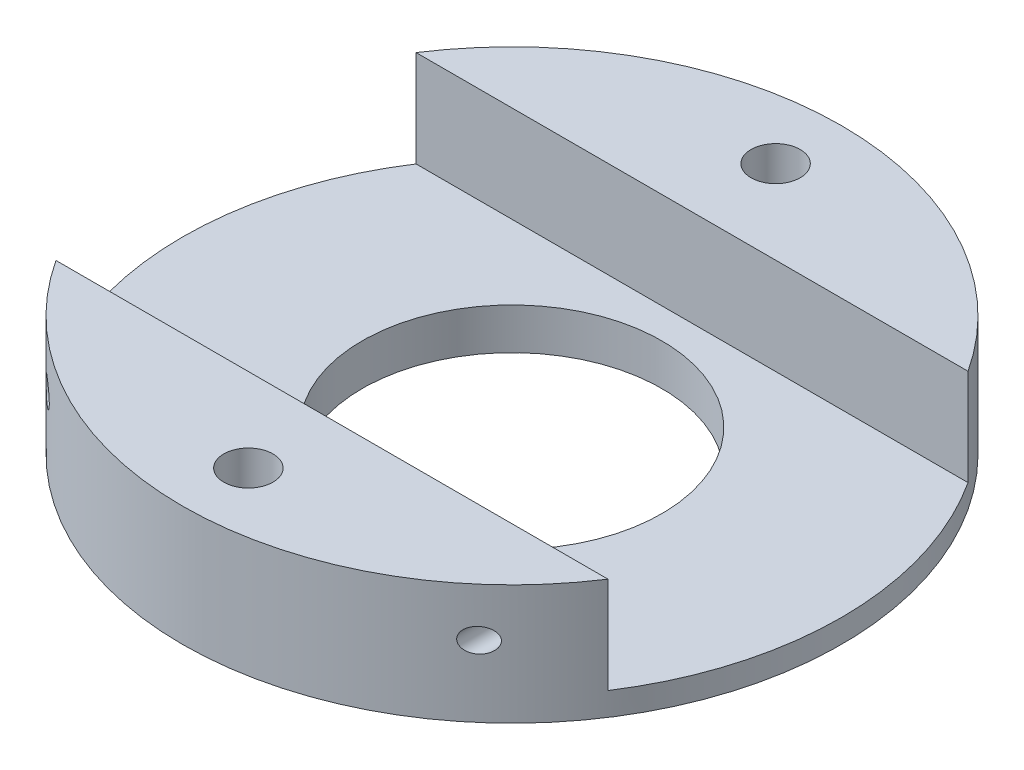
from build123d import *

# Parameters (mm, degrees)
SKETCH1_R                  = 27.5
BOSS_EXTRUDE1_DEPTH        = 10
SKETCH2_W                  = 60
SKETCH2_H                  = 30.05
CUT_EXTRUDE1_DEPTH         = 8.05
F_4_1_4_1_DIAMETER_HOLE1_D = 4.1
SKETCH7_R                  = 1
CUT_EXTRUDE3_DEPTH         = 25
SKETCH8_R                  = 14.45
BOSS_EXTRUDE2_DEPTH        = 1.5
SKETCH9_R                  = 12.5
CUT_EXTRUDE4_DEPTH         = 40.715268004


with BuildPart() as part:
    # Sketch1 → Boss-Extrude1 (new body)
    with BuildSketch(Plane(origin=(0, 0, 0), x_dir=(1, 0, 0), z_dir=(0, 1, 0))):
        with Locations(Location((0, 0, 0), (0, 0, 270))):
            Circle(SKETCH1_R)
    extrude(amount=BOSS_EXTRUDE1_DEPTH)

    # Sketch2 → Cut-Extrude1 (cut)
    with BuildSketch(Plane(origin=(0, 10, 0), x_dir=(1, 0, 0), z_dir=(0, 1, 0))):
        Rectangle(SKETCH2_W, SKETCH2_H)
    extrude(amount=-CUT_EXTRUDE1_DEPTH, mode=Mode.SUBTRACT)

    # 4.1 _4.1_ Diameter Hole1 (through all)
    with Locations(Plane(origin=(0, 10, 0), x_dir=(1, 0, 0), z_dir=(0, 1, 0))):
        with Locations((0, 22), (0, -22)):
            Hole(F_4_1_4_1_DIAMETER_HOLE1_D / 2)

    # Sketch7 → Cut-Extrude3 (cut)
    with BuildSketch(Plane.XY):
        with Locations(Location((-18, 5.95, 0), (0, 0, 180))):
            Circle(SKETCH7_R)
        with Locations(Location((18, 5.95, 0), (0, 0, 180))):
            Circle(SKETCH7_R)
    extrude(amount=CUT_EXTRUDE3_DEPTH, mode=Mode.SUBTRACT)

    # Sketch8 → Boss-Extrude2 (add)
    with BuildSketch(Plane(origin=(0, 0, 0), x_dir=(-1, 0, 0), z_dir=(0, -1, 0))):
        with Locations(Location((0, 0, 0), (0, 0, 270))):
            Circle(SKETCH8_R)
    extrude(amount=BOSS_EXTRUDE2_DEPTH)

    # Sketch9 → Cut-Extrude4 (cut, through all)
    with BuildSketch(Plane(origin=(0, 1.95, 0), x_dir=(1, 0, 0), z_dir=(0, 1, 0))):
        with Locations(Location((0, 0, 0), (0, 0, 270))):
            Circle(SKETCH9_R)
    extrude(amount=-CUT_EXTRUDE4_DEPTH, mode=Mode.SUBTRACT)


solid = part.part
